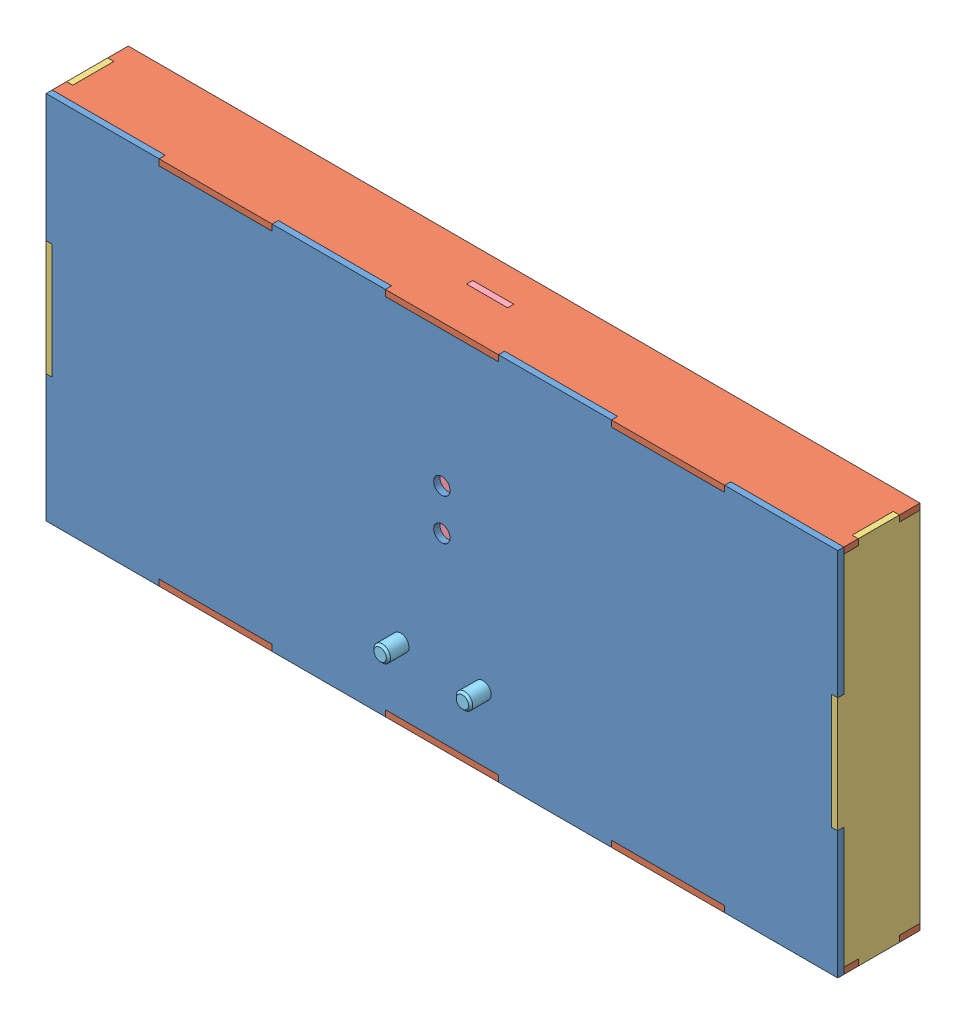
SolidWorks assembly Structure support.SLDASM, configuration Défaut (file format 12000). Lengths in mm.
Overall size (385 180 50).
8 component instances, 5 part files, 11 mates.
Components (placement in the parent):
- Structure support socle-1: Structure support socle.SLDPRT [Défaut] at origin size (385 180 3)
- Structure support coté 1-1: Structure support coté 1.SLDPRT [Défaut] at (0 -87 -17) x (1 0 0) z (0 -1 0) size (385 40 3)
- Structure support coté 1-2: Structure support coté 1.SLDPRT [Défaut] at (0 90 -17) x (1 0 0) z (0 -1 0) size (385 40 3)
- Structure support coté 2-1: Structure support coté 2.SLDPRT [Défaut] at (-192.5 0 -17) x (1 0 0) z (0 -1 0) size (3 40 180)
- Structure support coté 2-2: Structure support coté 2.SLDPRT [Défaut] at (192.5 0 -17) x (-1 0 0) z (0 1 0) size (3 40 180)
- Structure support renfort-1: Structure support renfort.SLDPRT [Défaut] at (0 0 -22) x (1 0 0) z (0 -1 0) size (60 3 180)
- Structure support axe L35-1: Structure support axe L35.SLDPRT [Défaut] at (-20 -55 -22) size (8 8 35)
- Structure support axe L35-2: Structure support axe L35.SLDPRT [Défaut] at (20 -55 13) x (-1 0 0) z (0 0 -1) size (8 8 35)
Mates (geometry in assembly coordinates):
- Coïncidente1: coincident anti-aligned: plane of Structure support socle-1 through (0 0 0) normal (0 0 -1); plane of Structure support coté 1-1 through (-192.5 -87 0) normal (0 0 1)
- Coïncidente2: coincident anti-aligned: plane of Structure support socle-1 through (-137.5 -87 0) normal (0 -1 0); plane of Structure support coté 1-1 through (0 -87 -17) normal (0 1 0)
- Coïncidente3: coincident anti-aligned: plane of Structure support socle-1 through (-137.5 -90 0) normal (1 0 0); plane of Structure support coté 1-1 through (-137.5 -87 3) normal (-1 0 0)
- Coïncidente4: coincident anti-aligned: plane of Structure support socle-1 through (0 0 0) normal (0 0 -1); plane of Structure support coté 2-1 through (-192.5 -87 0) normal (0 0 1)
- Coïncidente6: coincident anti-aligned: plane of Structure support socle-1 through (-189.5 -28 0) normal (-1 0 0); plane of Structure support coté 2-1 through (-189.5 0 -17) normal (1 0 0)
- Coïncidente7: coincident anti-aligned: plane of Structure support socle-1 through (-189.5 -28 0) normal (0 1 0); plane of Structure support coté 2-1 through (-192.5 -28 3) normal (0 -1 0)
- Coïncidente8: coincident aligned: plane of Structure support coté 1-2 through (0 90 -17) normal (0 1 0); plane of Structure support renfort-1 through (-30 90 -19) normal (0 1 0)
- Coïncidente9: coincident anti-aligned: plane of Structure support coté 1-2 through (-10 90 -22) normal (0 0 1); plane of Structure support renfort-1 through (0 0 -22) normal (0 0 -1)
- Coïncidente10: coincident anti-aligned: plane of Structure support coté 1-2 through (-10 90 -19) normal (1 0 0); plane of Structure support renfort-1 through (-10 90 -22) normal (-1 0 0)
- Coaxiale1: concentric aligned: cylinder of Structure support socle-1 through (-20 -55 3) axis (0 0 -1) radius 4; cylinder of Structure support axe-1 through (-20 -55 13) axis (0 0 -1) radius 4
- Coïncidente11: coincident aligned: plane of Structure support renfort-1 through (0 0 -22) normal (0 0 -1); plane of Structure support axe-1 through (-20 -55 -22) normal (0 0 -1)
